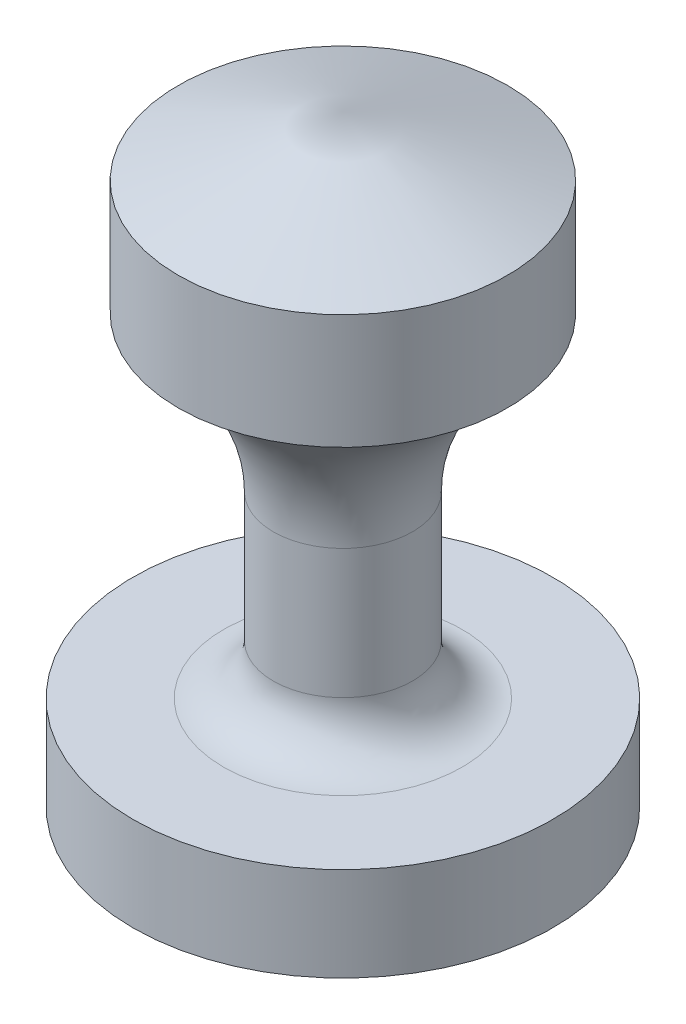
ISO-10303-21;
HEADER;
FILE_DESCRIPTION(('STEP AP214'),'2;1');
FILE_NAME('part.step','',(''),(''),'','','');
FILE_SCHEMA(('AUTOMOTIVE_DESIGN { 1 0 10303 214 1 1 1 1 }'));
ENDSEC;
DATA;
#1=APPLICATION_CONTEXT('core data for automotive mechanical design processes');
#2=APPLICATION_PROTOCOL_DEFINITION('international standard','automotive_design',2000,#1);
#3=PRODUCT_CONTEXT('',#1,'mechanical');
#4=PRODUCT('Part','Part','',(#3));
#5=PRODUCT_RELATED_PRODUCT_CATEGORY('part','',(#4));
#6=PRODUCT_DEFINITION_FORMATION('','',#4);
#7=PRODUCT_DEFINITION_CONTEXT('part definition',#1,'design');
#8=PRODUCT_DEFINITION('design','',#6,#7);
#9=PRODUCT_DEFINITION_SHAPE('','',#8);
#10=(LENGTH_UNIT() NAMED_UNIT(*) SI_UNIT(.MILLI.,.METRE.));
#11=(NAMED_UNIT(*) PLANE_ANGLE_UNIT() SI_UNIT($,.RADIAN.));
#12=(NAMED_UNIT(*) SI_UNIT($,.STERADIAN.) SOLID_ANGLE_UNIT());
#13=UNCERTAINTY_MEASURE_WITH_UNIT(LENGTH_MEASURE(1.E-05),#10,'distance_accuracy_value','');
#14=(GEOMETRIC_REPRESENTATION_CONTEXT(3) GLOBAL_UNCERTAINTY_ASSIGNED_CONTEXT((#13)) GLOBAL_UNIT_ASSIGNED_CONTEXT((#10,
#11,#12)) REPRESENTATION_CONTEXT('',''));
#15=CARTESIAN_POINT('',(0.,0.,0.));
#16=DIRECTION('',(0.,0.,1.));
#17=DIRECTION('',(1.,0.,0.));
#18=AXIS2_PLACEMENT_3D('',#15,#16,#17);
#19=CARTESIAN_POINT('',(0.,87.4906887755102,0.));
#20=DIRECTION('',(0.,-1.,0.));
#21=DIRECTION('',(0.,0.,-1.));
#22=AXIS2_PLACEMENT_3D('',#19,#20,#21);
#23=CONICAL_SURFACE('',#22,26.5501275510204,1.22310348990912);
#24=CARTESIAN_POINT('',(0.,97.1128826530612,0.));
#25=VERTEX_POINT('',#24);
#26=VERTEX_LOOP('',#25);
#27=FACE_BOUND('',#26,.T.);
#28=CARTESIAN_POINT('',(0.,87.4906887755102,0.));
#29=DIRECTION('',(0.,1.,0.));
#30=DIRECTION('',(0.,0.,1.));
#31=AXIS2_PLACEMENT_3D('',#28,#29,#30);
#32=CIRCLE('',#31,26.5501275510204);
#33=CARTESIAN_POINT('',(0.,87.4906887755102,26.5501275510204));
#34=VERTEX_POINT('',#33);
#35=EDGE_CURVE('E11',#34,#34,#32,.T.);
#36=ORIENTED_EDGE('',*,*,#35,.T.);
#37=EDGE_LOOP('',(#36));
#38=FACE_BOUND('',#37,.T.);
#39=ADVANCED_FACE('F31',(#27,#38),#23,.T.);
#40=CARTESIAN_POINT('',(0.,97.1128826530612,0.));
#41=DIRECTION('',(0.,1.,0.));
#42=DIRECTION('',(0.,0.,1.));
#43=AXIS2_PLACEMENT_3D('',#40,#41,#42);
#44=CYLINDRICAL_SURFACE('',#43,26.5501275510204);
#45=ORIENTED_EDGE('',*,*,#35,.F.);
#46=EDGE_LOOP('',(#45));
#47=FACE_BOUND('',#46,.T.);
#48=CARTESIAN_POINT('',(0.,68.959056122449,0.));
#49=DIRECTION('',(0.,1.,0.));
#50=DIRECTION('',(0.,0.,1.));
#51=AXIS2_PLACEMENT_3D('',#48,#49,#50);
#52=CIRCLE('',#51,26.5501275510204);
#53=CARTESIAN_POINT('',(0.,68.959056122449,26.5501275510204));
#54=VERTEX_POINT('',#53);
#55=EDGE_CURVE('E37',#54,#54,#52,.T.);
#56=ORIENTED_EDGE('',*,*,#55,.T.);
#57=EDGE_LOOP('',(#56));
#58=FACE_BOUND('',#57,.T.);
#59=ADVANCED_FACE('F42',(#47,#58),#44,.T.);
#60=CARTESIAN_POINT('',(0.,44.0126275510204,0.));
#61=DIRECTION('',(0.,1.,0.));
#62=DIRECTION('',(0.,0.,1.));
#63=AXIS2_PLACEMENT_3D('',#60,#61,#62);
#64=TOROIDAL_SURFACE('',#63,39.1932427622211,27.9673499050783);
#65=ORIENTED_EDGE('',*,*,#55,.F.);
#66=EDGE_LOOP('',(#65));
#67=FACE_BOUND('',#66,.T.);
#68=CARTESIAN_POINT('',(0.,44.0126275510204,0.));
#69=DIRECTION('',(0.,1.,0.));
#70=DIRECTION('',(0.,0.,1.));
#71=AXIS2_PLACEMENT_3D('',#68,#69,#70);
#72=CIRCLE('',#71,11.2258928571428);
#73=CARTESIAN_POINT('',(0.,44.0126275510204,11.2258928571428));
#74=VERTEX_POINT('',#73);
#75=EDGE_CURVE('E51',#74,#74,#72,.T.);
#76=ORIENTED_EDGE('',*,*,#75,.T.);
#77=EDGE_LOOP('',(#76));
#78=FACE_BOUND('',#77,.T.);
#79=ADVANCED_FACE('F47',(#67,#78),#64,.F.);
#80=CARTESIAN_POINT('',(0.,97.1128826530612,0.));
#81=DIRECTION('',(0.,1.,0.));
#82=DIRECTION('',(0.,0.,1.));
#83=AXIS2_PLACEMENT_3D('',#80,#81,#82);
#84=CYLINDRICAL_SURFACE('',#83,11.2258928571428);
#85=ORIENTED_EDGE('',*,*,#75,.F.);
#86=EDGE_LOOP('',(#85));
#87=FACE_BOUND('',#86,.T.);
#88=CARTESIAN_POINT('',(0.,23.1645408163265,0.));
#89=DIRECTION('',(0.,1.,0.));
#90=DIRECTION('',(0.,0.,1.));
#91=AXIS2_PLACEMENT_3D('',#88,#89,#90);
#92=CIRCLE('',#91,11.2258928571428);
#93=CARTESIAN_POINT('',(0.,23.1645408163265,11.2258928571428));
#94=VERTEX_POINT('',#93);
#95=EDGE_CURVE('E53',#94,#94,#92,.T.);
#96=ORIENTED_EDGE('',*,*,#95,.T.);
#97=EDGE_LOOP('',(#96));
#98=FACE_BOUND('',#97,.T.);
#99=ADVANCED_FACE('F86',(#87,#98),#84,.T.);
#100=CARTESIAN_POINT('',(0.,23.1645408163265,0.));
#101=DIRECTION('',(0.,1.,0.));
#102=DIRECTION('',(0.,0.,1.));
#103=AXIS2_PLACEMENT_3D('',#100,#101,#102);
#104=TOROIDAL_SURFACE('',#103,19.244387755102,8.01849489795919);
#105=ORIENTED_EDGE('',*,*,#95,.F.);
#106=EDGE_LOOP('',(#105));
#107=FACE_BOUND('',#106,.T.);
#108=CARTESIAN_POINT('',(0.,15.1460459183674,0.));
#109=DIRECTION('',(0.,1.,0.));
#110=DIRECTION('',(0.,0.,1.));
#111=AXIS2_PLACEMENT_3D('',#108,#109,#110);
#112=CIRCLE('',#111,19.244387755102);
#113=CARTESIAN_POINT('',(0.,15.1460459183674,19.244387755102));
#114=VERTEX_POINT('',#113);
#115=EDGE_CURVE('E58',#114,#114,#112,.T.);
#116=ORIENTED_EDGE('',*,*,#115,.T.);
#117=EDGE_LOOP('',(#116));
#118=FACE_BOUND('',#117,.T.);
#119=ADVANCED_FACE('F82',(#107,#118),#104,.F.);
#120=CARTESIAN_POINT('',(33.8558673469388,15.1460459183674,0.));
#121=DIRECTION('',(0.,-1.,0.));
#122=DIRECTION('',(0.,0.,-1.));
#123=AXIS2_PLACEMENT_3D('',#120,#121,#122);
#124=PLANE('',#123);
#125=ORIENTED_EDGE('',*,*,#115,.F.);
#126=EDGE_LOOP('',(#125));
#127=FACE_BOUND('',#126,.T.);
#128=CARTESIAN_POINT('',(0.,15.1460459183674,0.));
#129=DIRECTION('',(0.,1.,0.));
#130=DIRECTION('',(0.,0.,1.));
#131=AXIS2_PLACEMENT_3D('',#128,#129,#130);
#132=CIRCLE('',#131,33.8558673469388);
#133=CARTESIAN_POINT('',(0.,15.1460459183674,33.8558673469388));
#134=VERTEX_POINT('',#133);
#135=EDGE_CURVE('E61',#134,#134,#132,.T.);
#136=ORIENTED_EDGE('',*,*,#135,.T.);
#137=EDGE_LOOP('',(#136));
#138=FACE_BOUND('',#137,.T.);
#139=ADVANCED_FACE('F76',(#127,#138),#124,.F.);
#140=CARTESIAN_POINT('',(0.,97.1128826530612,0.));
#141=DIRECTION('',(0.,1.,0.));
#142=DIRECTION('',(0.,0.,1.));
#143=AXIS2_PLACEMENT_3D('',#140,#141,#142);
#144=CYLINDRICAL_SURFACE('',#143,33.8558673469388);
#145=ORIENTED_EDGE('',*,*,#135,.F.);
#146=EDGE_LOOP('',(#145));
#147=FACE_BOUND('',#146,.T.);
#148=CARTESIAN_POINT('',(0.,0.,0.));
#149=DIRECTION('',(0.,1.,0.));
#150=DIRECTION('',(0.,0.,1.));
#151=AXIS2_PLACEMENT_3D('',#148,#149,#150);
#152=CIRCLE('',#151,33.8558673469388);
#153=CARTESIAN_POINT('',(0.,0.,33.8558673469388));
#154=VERTEX_POINT('',#153);
#155=EDGE_CURVE('E64',#154,#154,#152,.T.);
#156=ORIENTED_EDGE('',*,*,#155,.T.);
#157=EDGE_LOOP('',(#156));
#158=FACE_BOUND('',#157,.T.);
#159=ADVANCED_FACE('F68',(#147,#158),#144,.T.);
#160=CARTESIAN_POINT('',(0.,0.,0.));
#161=DIRECTION('',(0.,1.,0.));
#162=DIRECTION('',(0.,0.,1.));
#163=AXIS2_PLACEMENT_3D('',#160,#161,#162);
#164=PLANE('',#163);
#165=ORIENTED_EDGE('',*,*,#155,.F.);
#166=EDGE_LOOP('',(#165));
#167=FACE_BOUND('',#166,.T.);
#168=ADVANCED_FACE('F70',(#167),#164,.F.);
#169=CLOSED_SHELL('',(#39,#59,#79,#99,#119,#139,#159,#168));
#170=MANIFOLD_SOLID_BREP('B2',#169);
#171=ADVANCED_BREP_SHAPE_REPRESENTATION('',(#18,#170),#14);
#172=SHAPE_DEFINITION_REPRESENTATION(#9,#171);
ENDSEC;
END-ISO-10303-21;
